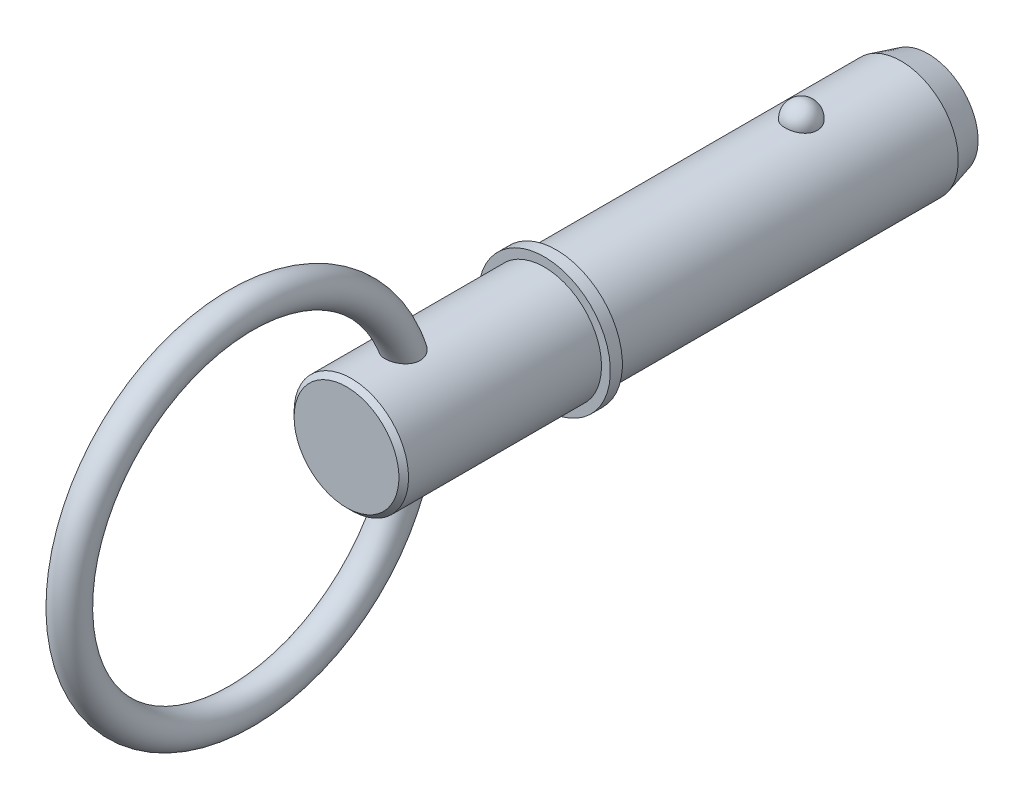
from build123d import *

# Parameters (mm, degrees)
SKETCH2_R           = 9.525
BOSS_EXTRUDE1_DEPTH = 38.1
BOSS_EXTRUDE2_START = 23.8
SKETCH3_R           = 9.525
BOSS_EXTRUDE2_DEPTH = 23.8
CHAMFER1_SIZE       = 4.5
CHAMFER1_SIZE2      = 1.205771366
SKETCH20_W          = 2
SKETCH20_H          = 11
SKETCH21_R          = 9.525
BOSS_EXTRUDE3_DEPTH = 34.93
CHAMFER2_SIZE       = 0.8
SKETCH24_R          = 2.75


with BuildPart() as part:
    # Sketch2 → Boss-Extrude1 (new body)
    with BuildSketch(Plane.XY):
        with Locations(Location((0, 0, 0), (0, 0, 180))):
            Circle(SKETCH2_R)
    extrude(amount=BOSS_EXTRUDE1_DEPTH)

    # Sketch3 → Boss-Extrude2 (add)
    with BuildSketch(Plane(origin=(0, 0, 0), x_dir=(-1, 0, 0), z_dir=(0, 0, -1)).offset(BOSS_EXTRUDE2_START)):
        Circle(SKETCH3_R)
    extrude(amount=-BOSS_EXTRUDE2_DEPTH)

    # Chamfer1
    chamfer1_edges = [part.edges().sort_by_distance(p)[0] for p in [
        (9.525, 0, -23.8),
    ]]
    chamfer1_side = [part.faces().sort_by_distance(p)[0] for p in [
        (9.525, 0, 7.15),
    ]]
    chamfer(chamfer1_edges, length=CHAMFER1_SIZE, length2=CHAMFER1_SIZE2, reference=chamfer1_side[0])

    # Sketch18 → Revolve1 (revolve)
    with BuildSketch(Plane(origin=(0, 0, 0), x_dir=(0, 0, -1), z_dir=(1, 0, 0))):
        with BuildLine():
            Line((2.69, 12.215), (2.69, 6.835))
            ThreePointArc((2.69, 6.835), (0, 9.525), (2.69, 12.215))
        make_face()
    revolve(axis=Axis((0, 12.215, -2.69), (0, -1, 0)))

    # Sketch20 → Revolve2 (revolve)
    with BuildSketch(Plane(origin=(0, 0, 0), x_dir=(0, 0, -1), z_dir=(1, 0, 0)), mode=Mode.PRIVATE) as revolve2_sk:
        with Locations((-39.1, 5.5)):
            Rectangle(SKETCH20_W, SKETCH20_H)
    revolve(revolve2_sk.sketch.rotate(Axis((0, 0, 33.728787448), (0, 0, 1)), 90), axis=Axis((0, 0, 33.728787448), (0, 0, 1)))

    # Sketch21 → Boss-Extrude3 (add)
    with BuildSketch(Plane(origin=(0, 0, 38.1), x_dir=(-1, 0, 0), z_dir=(0, 0, -1))):
        Circle(SKETCH21_R)
    extrude(amount=-BOSS_EXTRUDE3_DEPTH)

    # Chamfer2
    chamfer2_edges = [part.edges().sort_by_distance(p)[0] for p in [
        (9.525, 0, 73.03),
    ]]
    chamfer(chamfer2_edges, length=CHAMFER2_SIZE)

    # Sweep1: sweep along a path in Sketch23
    with BuildLine(Plane(origin=(0, 0, 0), x_dir=(0, 0, -1), z_dir=(1, 0, 0))) as sweep1_path:
        CenterArc((-90.605, 0), 28.575, 0, 360)
    # Sketch24 → Sweep1 (sweep)
    with BuildSketch(Plane(origin=(0, 0, 0), x_dir=(1, 0, 0), z_dir=(0, 1, 0))):
        with Locations((0, -62.03)):
            Circle(SKETCH24_R)
    sweep(path=sweep1_path.line)


solid = part.part
